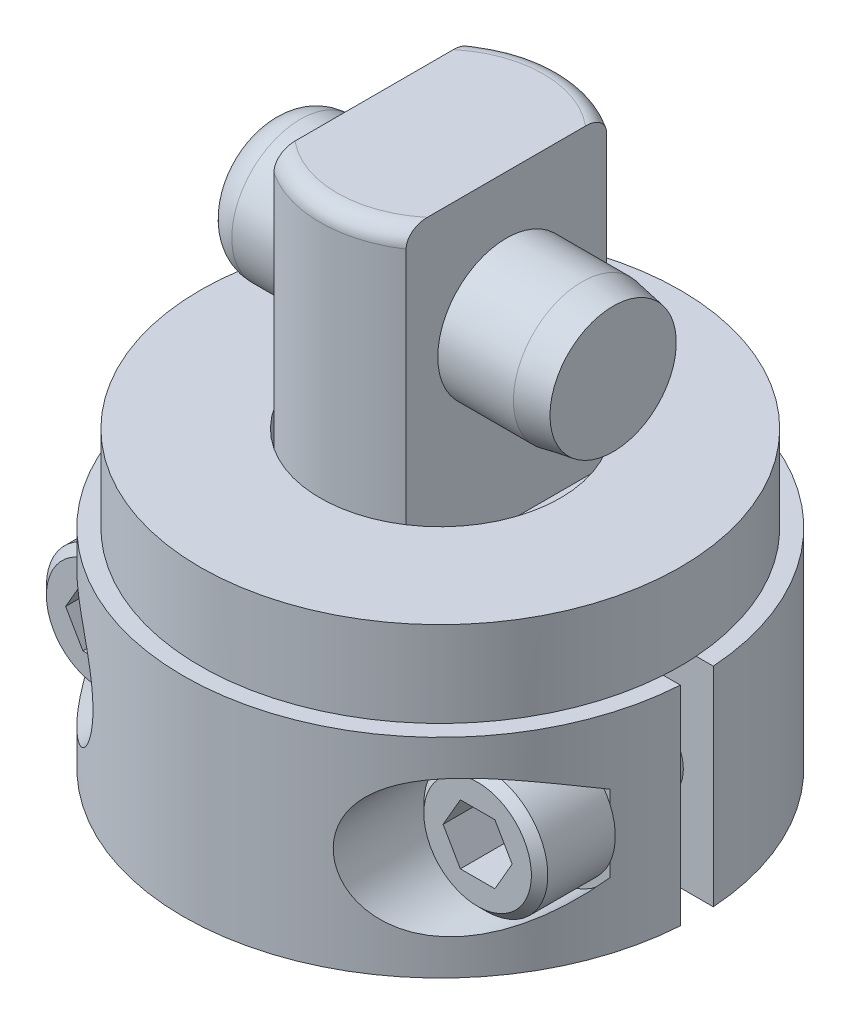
from build123d import *

# Parameters (mm, degrees)
FILLET1_R                  = 0.7874
CUT_EXTRUDE1_DEPTH         = 23.074134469
CUT_EXTRUDE1_DEPTH_BACK    = 23.074134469
SKETCH2_W                  = 2.5019
SKETCH2_H                  = 14.0716
CUT_EXTRUDE2_START         = 2.54
SKETCH3_R                  = 3.175
SKETCH3_R_2                = 2.5781
CUT_EXTRUDE2_DEPTH         = 2.54
CHAMFER1_SIZE              = 0.762
SKETCH4_R                  = 3.17754
EXTRUDE1_DEPTH             = 8.001
CHAMFER2_SIZE              = 0.254
CHAMFER2_SIZE2             = 1.440505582
FILLET2_R                  = 1.524
EXTRUDE2_DEPTH             = 4.826
EXTRUDE2_DEPTH_BACK        = 4.826
CUT_EXTRUDE3_START         = 2.7432
SKETCH6_R                  = 3.175
CUT_EXTRUDE3_DEPTH         = 25.214787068
SKETCH7_R                  = 2.8702
EXTRUDE3_DEPTH             = 3.5052
CHAMFER3_SIZE              = 0.381
CUT_EXTRUDE4_DEPTH         = 2.7686
EXTRUDE4_REACH             = 28.609
SKETCH10_R                 = 1.7526
EXTRUDE4_DIRECTION_2_REACH = 28.609
SKETCH11_R                 = 11.1125
SKETCH11_R_2               = 5.5626
EXTRUDE5_DEPTH             = 3.9624


with BuildPart() as part:
    # Sketch1 → Revolve1 (revolve)
    with BuildSketch(Plane(origin=(0, 0, 0), x_dir=(0, 0, -1), z_dir=(1, 0, 0))):
        Polygon((0, 20.6248), (5.5626, 20.6248), (5.5626, 0), (3.175, 0), (3.175, -6.35), (0, -6.35), align=None)
    revolve(axis=Axis((0, -15.35938, 0), (0, 1, 0)))

    # Fillet1
    fillet1_edges = [part.edges().sort_by_distance(p)[0] for p in [
        (0, 20.6248, 5.5626),
    ]]
    fillet(fillet1_edges, radius=FILLET1_R)

    # Sketch2 → Cut-Extrude1 (cut, two sides: drawn at the far end of the back side and taken through both)
    with BuildSketch(Plane.XY.offset(-CUT_EXTRUDE1_DEPTH_BACK)):
        with Locations((4.31165, 13.589)):
            Rectangle(SKETCH2_W, SKETCH2_H)
        with Locations((-4.31165, 13.589)):
            Rectangle(SKETCH2_W, SKETCH2_H)
    extrude(amount=CUT_EXTRUDE1_DEPTH + CUT_EXTRUDE1_DEPTH_BACK, mode=Mode.SUBTRACT)

    # Sketch3 → Cut-Extrude2 (cut)
    with BuildSketch(Plane.XZ.offset(CUT_EXTRUDE2_START)):
        with Locations(Location((0, 0, 0), (0, 0, 270))):
            Circle(SKETCH3_R)
        with Locations(Location((0, 0, 0), (0, 0, 270))):
            Circle(SKETCH3_R_2, mode=Mode.SUBTRACT)
    extrude(amount=-CUT_EXTRUDE2_DEPTH, mode=Mode.SUBTRACT)

    # Chamfer1
    chamfer1_edges = [part.edges().sort_by_distance(p)[0] for p in [
        (0, -6.35, 3.175),
    ]]
    chamfer(chamfer1_edges, length=CHAMFER1_SIZE)

    # Sketch4 → Extrude1 (add, symmetric)
    with BuildSketch(Plane(origin=(0, 0, 0), x_dir=(0, 0, -1), z_dir=(1, 0, 0))):
        with Locations(Location((0, 14.7828, 0), (0, 0, 90))):
            Circle(SKETCH4_R)
    extrude(amount=EXTRUDE1_DEPTH, both=True)

    # Chamfer2
    chamfer2_edges = [part.edges().sort_by_distance(p)[0] for p in [
        (8.001, 11.60526, 0),
    ]]
    chamfer2_side = [part.faces().sort_by_distance(p)[0] for p in [
        (8.001, 14.7828, 0),
    ]]
    chamfer(chamfer2_edges, length=CHAMFER2_SIZE, length2=CHAMFER2_SIZE2, reference=chamfer2_side[0])

    # Fillet2
    fillet2_edges = [part.edges().sort_by_distance(p)[0] for p in [
        (-8.001, 11.60526, 0),
    ]]
    fillet(fillet2_edges, radius=FILLET2_R)

    # Sketch5 → Extrude2 (add, two sides: drawn at the far end of the back side and taken through both)
    with BuildSketch(Plane(origin=(0, 0, 0), x_dir=(1, 0, 0), z_dir=(0, 1, 0)).offset(-EXTRUDE2_DEPTH_BACK)):
        with BuildLine():
            Line((5.510161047, 0.762), (11.875477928, 0.762))
            ThreePointArc((11.875477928, 0.762), (0, 11.8999), (-11.875477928, 0.762))
            Line((-11.875477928, 0.762), (-5.510161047, 0.762))
            ThreePointArc((-5.510161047, 0.762), (0, 5.5626), (5.510161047, 0.762))
        make_face()
        with BuildLine():
            Line((5.510161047, -0.762), (11.875477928, -0.762))
            ThreePointArc((11.875477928, -0.762), (0, -11.8999), (-11.875477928, -0.762))
            Line((-11.875477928, -0.762), (-5.510161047, -0.762))
            ThreePointArc((-5.510161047, -0.762), (0, -5.5626), (5.510161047, -0.762))
        make_face()
    extrude(amount=EXTRUDE2_DEPTH + EXTRUDE2_DEPTH_BACK)

    # Sketch6 → Cut-Extrude3 (cut, through all)
    with BuildSketch(Plane.XY.offset(0.762).offset(CUT_EXTRUDE3_START)):
        with Locations((8.7376, 0)):
            Circle(SKETCH6_R)
        with Locations((-8.7376, 0)):
            Circle(SKETCH6_R)
    extrude(amount=CUT_EXTRUDE3_DEPTH, mode=Mode.SUBTRACT)

    # Sketch7 → Extrude3 (add)
    with BuildSketch(Plane.XY.offset(3.5052)):
        with Locations(Location((8.7376, 0, 0), (0, 0, 336.610472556))):
            Circle(SKETCH7_R)
        with Locations(Location((-8.7376, 0, 0), (0, 0, 156.610472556))):
            Circle(SKETCH7_R)
    extrude(amount=EXTRUDE3_DEPTH)

    # Chamfer3
    chamfer3_edges = [part.edges().sort_by_distance(p)[0] for p in [
        (6.103252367, 1.139412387, 7.0104),
        (-6.103252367, -1.139412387, 7.0104),
    ]]
    chamfer(chamfer3_edges, length=CHAMFER3_SIZE)

    # Sketch8 → Cut-Extrude4 (cut)
    with BuildSketch(Plane.XY.offset(7.0104)):
        Polygon((9.536825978, 1.3843), (10.336051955, 0), (9.536825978, -1.3843), (7.938374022, -1.3843), (7.139148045, 0), (7.938374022, 1.3843), align=None)
        Polygon((-10.336051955, 0), (-9.536825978, -1.3843), (-7.938374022, -1.3843), (-7.139148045, 0), (-7.938374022, 1.3843), (-9.536825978, 1.3843), align=None)
    extrude(amount=-CUT_EXTRUDE4_DEPTH, mode=Mode.SUBTRACT)

    # Sketch10 → Extrude4 (add, up to next)
    with BuildSketch(Plane.XY, mode=Mode.PRIVATE) as extrude4_sk1:
        with Locations((8.7376, 0)):
            Circle(SKETCH10_R)
    extrude4_tool1 = extrude(extrude4_sk1.sketch, amount=EXTRUDE4_REACH, mode=Mode.PRIVATE) - part.part
    # Sketch10 → Extrude4 (add, up to next)
    with BuildSketch(Plane.XY, mode=Mode.PRIVATE) as extrude4_sk2:
        with Locations((-8.7376, 0)):
            Circle(SKETCH10_R)
    extrude4_tool2 = extrude(extrude4_sk2.sketch, amount=EXTRUDE4_REACH, mode=Mode.PRIVATE) - part.part
    add(extrude4_tool1.solids().sort_by_distance((8.7376, 0, 0))[0])
    add(extrude4_tool2.solids().sort_by_distance((-8.7376, 0, 0))[0])

    # Sketch10 → Extrude4 direction 2 (add, up to next)
    with BuildSketch(Plane.XY, mode=Mode.PRIVATE) as extrude4_direction_2_sk1:
        with Locations((8.7376, 0)):
            Circle(SKETCH10_R)
    extrude4_direction_2_tool1 = extrude(extrude4_direction_2_sk1.sketch, amount=-EXTRUDE4_DIRECTION_2_REACH, mode=Mode.PRIVATE) - part.part
    # Sketch10 → Extrude4 direction 2 (add, up to next)
    with BuildSketch(Plane.XY, mode=Mode.PRIVATE) as extrude4_direction_2_sk2:
        with Locations((-8.7376, 0)):
            Circle(SKETCH10_R)
    extrude4_direction_2_tool2 = extrude(extrude4_direction_2_sk2.sketch, amount=-EXTRUDE4_DIRECTION_2_REACH, mode=Mode.PRIVATE) - part.part
    add(extrude4_direction_2_tool1.solids().sort_by_distance((8.7376, 0, 0))[0])
    add(extrude4_direction_2_tool2.solids().sort_by_distance((-8.7376, 0, 0))[0])

    # Sketch11 → Extrude5 (add)
    with BuildSketch(Plane(origin=(0, 4.826, 0), x_dir=(-1, 0, 0), z_dir=(0, 1, 0))):
        with Locations(Location((0, 0, 0), (0, 0, 183.931938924))):
            Circle(SKETCH11_R)
        Circle(SKETCH11_R_2, mode=Mode.SUBTRACT)
    extrude(amount=EXTRUDE5_DEPTH)


solid = part.part
